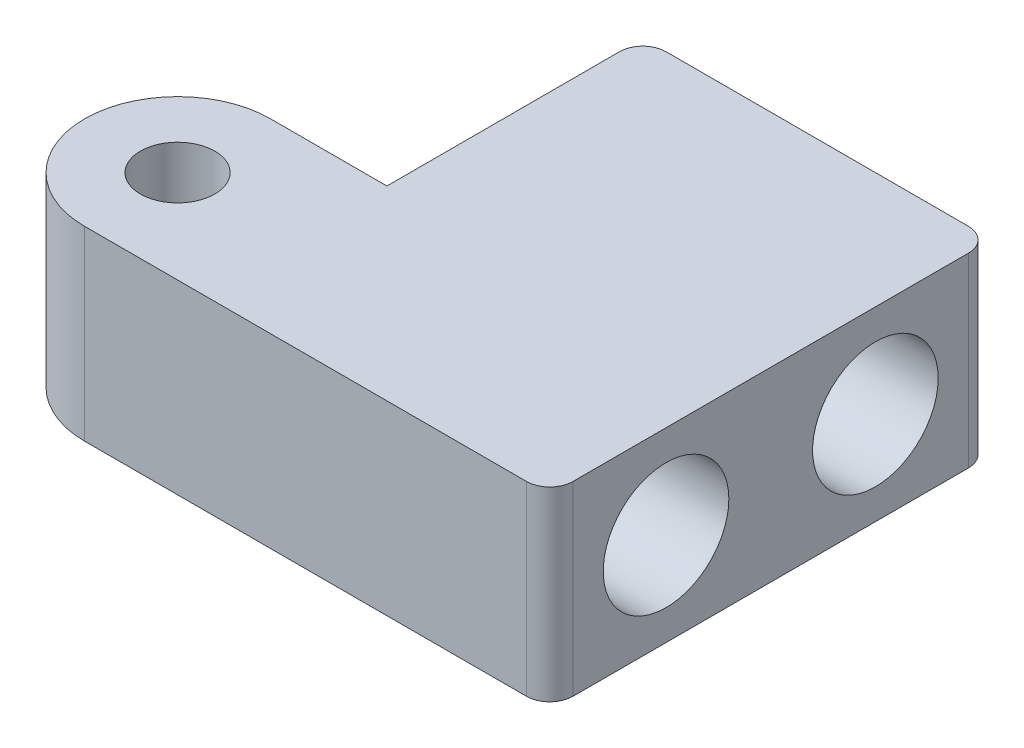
ISO-10303-21;
HEADER;
FILE_DESCRIPTION(('STEP AP214'),'2;1');
FILE_NAME('part.step','',(''),(''),'','','');
FILE_SCHEMA(('AUTOMOTIVE_DESIGN { 1 0 10303 214 1 1 1 1 }'));
ENDSEC;
DATA;
#1=APPLICATION_CONTEXT('core data for automotive mechanical design processes');
#2=APPLICATION_PROTOCOL_DEFINITION('international standard','automotive_design',2000,#1);
#3=PRODUCT_CONTEXT('',#1,'mechanical');
#4=PRODUCT('Part','Part','',(#3));
#5=PRODUCT_RELATED_PRODUCT_CATEGORY('part','',(#4));
#6=PRODUCT_DEFINITION_FORMATION('','',#4);
#7=PRODUCT_DEFINITION_CONTEXT('part definition',#1,'design');
#8=PRODUCT_DEFINITION('design','',#6,#7);
#9=PRODUCT_DEFINITION_SHAPE('','',#8);
#10=(LENGTH_UNIT() NAMED_UNIT(*) SI_UNIT(.MILLI.,.METRE.));
#11=(NAMED_UNIT(*) PLANE_ANGLE_UNIT() SI_UNIT($,.RADIAN.));
#12=(NAMED_UNIT(*) SI_UNIT($,.STERADIAN.) SOLID_ANGLE_UNIT());
#13=UNCERTAINTY_MEASURE_WITH_UNIT(LENGTH_MEASURE(1.E-05),#10,'distance_accuracy_value','');
#14=(GEOMETRIC_REPRESENTATION_CONTEXT(3) GLOBAL_UNCERTAINTY_ASSIGNED_CONTEXT((#13)) GLOBAL_UNIT_ASSIGNED_CONTEXT((#10,
#11,#12)) REPRESENTATION_CONTEXT('',''));
#15=CARTESIAN_POINT('',(0.,0.,0.));
#16=DIRECTION('',(0.,0.,1.));
#17=DIRECTION('',(1.,0.,0.));
#18=AXIS2_PLACEMENT_3D('',#15,#16,#17);
#19=CARTESIAN_POINT('',(20.,8.,0.));
#20=DIRECTION('',(1.,0.,0.));
#21=DIRECTION('',(0.,0.,-1.));
#22=AXIS2_PLACEMENT_3D('',#19,#20,#21);
#23=PLANE('',#22);
#24=CARTESIAN_POINT('',(20.,4.,-1.));
#25=DIRECTION('',(1.,0.,0.));
#26=DIRECTION('',(0.,0.,-1.));
#27=AXIS2_PLACEMENT_3D('',#24,#25,#26);
#28=CIRCLE('',#27,2.7);
#29=CARTESIAN_POINT('',(20.,4.,-3.7));
#30=VERTEX_POINT('',#29);
#31=EDGE_CURVE('E208',#30,#30,#28,.T.);
#32=ORIENTED_EDGE('',*,*,#31,.F.);
#33=EDGE_LOOP('',(#32));
#34=FACE_BOUND('',#33,.T.);
#35=CARTESIAN_POINT('',(20.,4.,-10.));
#36=DIRECTION('',(1.,0.,0.));
#37=DIRECTION('',(0.,0.,-1.));
#38=AXIS2_PLACEMENT_3D('',#35,#36,#37);
#39=CIRCLE('',#38,2.7);
#40=CARTESIAN_POINT('',(20.,4.,-12.7));
#41=VERTEX_POINT('',#40);
#42=EDGE_CURVE('E202',#41,#41,#39,.T.);
#43=ORIENTED_EDGE('',*,*,#42,.F.);
#44=EDGE_LOOP('',(#43));
#45=FACE_BOUND('',#44,.T.);
#46=DIRECTION('',(0.,0.,1.));
#47=VECTOR('',#46,1.);
#48=CARTESIAN_POINT('',(20.,8.,0.));
#49=LINE('',#48,#47);
#50=CARTESIAN_POINT('',(20.,8.,-14.));
#51=VERTEX_POINT('',#50);
#52=CARTESIAN_POINT('',(20.,8.,3.));
#53=VERTEX_POINT('',#52);
#54=EDGE_CURVE('E161',#51,#53,#49,.T.);
#55=ORIENTED_EDGE('',*,*,#54,.T.);
#56=DIRECTION('',(0.,-1.,0.));
#57=VECTOR('',#56,1.);
#58=CARTESIAN_POINT('',(20.,0.,3.));
#59=LINE('',#58,#57);
#60=CARTESIAN_POINT('',(20.,0.,3.));
#61=VERTEX_POINT('',#60);
#62=EDGE_CURVE('E43',#53,#61,#59,.T.);
#63=ORIENTED_EDGE('',*,*,#62,.T.);
#64=DIRECTION('',(0.,0.,1.));
#65=VECTOR('',#64,1.);
#66=CARTESIAN_POINT('',(20.,0.,0.));
#67=LINE('',#66,#65);
#68=CARTESIAN_POINT('',(20.,0.,-14.));
#69=VERTEX_POINT('',#68);
#70=EDGE_CURVE('E144',#69,#61,#67,.T.);
#71=ORIENTED_EDGE('',*,*,#70,.F.);
#72=DIRECTION('',(0.,-1.,0.));
#73=VECTOR('',#72,1.);
#74=CARTESIAN_POINT('',(20.,8.,-14.));
#75=LINE('',#74,#73);
#76=EDGE_CURVE('E181',#69,#51,#75,.F.);
#77=ORIENTED_EDGE('',*,*,#76,.T.);
#78=EDGE_LOOP('',(#55,#63,#71,#77));
#79=FACE_BOUND('',#78,.T.);
#80=ADVANCED_FACE('F35',(#34,#45,#79),#23,.T.);
#81=CARTESIAN_POINT('',(0.,8.,-15.));
#82=DIRECTION('',(0.,0.,-1.));
#83=DIRECTION('',(-1.,0.,0.));
#84=AXIS2_PLACEMENT_3D('',#81,#82,#83);
#85=PLANE('',#84);
#86=DIRECTION('',(1.,0.,0.));
#87=VECTOR('',#86,1.);
#88=CARTESIAN_POINT('',(0.,0.,-15.));
#89=LINE('',#88,#87);
#90=CARTESIAN_POINT('',(6.,0.,-15.));
#91=VERTEX_POINT('',#90);
#92=CARTESIAN_POINT('',(19.,0.,-15.));
#93=VERTEX_POINT('',#92);
#94=EDGE_CURVE('E147',#91,#93,#89,.T.);
#95=ORIENTED_EDGE('',*,*,#94,.F.);
#96=DIRECTION('',(0.,-1.,0.));
#97=VECTOR('',#96,1.);
#98=CARTESIAN_POINT('',(6.,8.,-15.));
#99=LINE('',#98,#97);
#100=CARTESIAN_POINT('',(6.,8.,-15.));
#101=VERTEX_POINT('',#100);
#102=EDGE_CURVE('E175',#91,#101,#99,.F.);
#103=ORIENTED_EDGE('',*,*,#102,.T.);
#104=DIRECTION('',(1.,0.,0.));
#105=VECTOR('',#104,1.);
#106=CARTESIAN_POINT('',(0.,8.,-15.));
#107=LINE('',#106,#105);
#108=CARTESIAN_POINT('',(19.,8.,-15.));
#109=VERTEX_POINT('',#108);
#110=EDGE_CURVE('E118',#101,#109,#107,.T.);
#111=ORIENTED_EDGE('',*,*,#110,.T.);
#112=DIRECTION('',(0.,-1.,0.));
#113=VECTOR('',#112,1.);
#114=CARTESIAN_POINT('',(19.,8.,-15.));
#115=LINE('',#114,#113);
#116=EDGE_CURVE('E172',#109,#93,#115,.T.);
#117=ORIENTED_EDGE('',*,*,#116,.T.);
#118=EDGE_LOOP('',(#95,#103,#111,#117));
#119=FACE_BOUND('',#118,.T.);
#120=ADVANCED_FACE('F198',(#119),#85,.T.);
#121=CARTESIAN_POINT('',(5.,8.,0.));
#122=DIRECTION('',(1.,0.,0.));
#123=DIRECTION('',(0.,0.,-1.));
#124=AXIS2_PLACEMENT_3D('',#121,#122,#123);
#125=PLANE('',#124);
#126=DIRECTION('',(0.,0.,1.));
#127=VECTOR('',#126,1.);
#128=CARTESIAN_POINT('',(5.,8.,0.));
#129=LINE('',#128,#127);
#130=CARTESIAN_POINT('',(5.,8.,-14.));
#131=VERTEX_POINT('',#130);
#132=CARTESIAN_POINT('',(5.,8.,-4.));
#133=VERTEX_POINT('',#132);
#134=EDGE_CURVE('E105',#131,#133,#129,.T.);
#135=ORIENTED_EDGE('',*,*,#134,.F.);
#136=DIRECTION('',(0.,-1.,0.));
#137=VECTOR('',#136,1.);
#138=CARTESIAN_POINT('',(5.,0.,-14.));
#139=LINE('',#138,#137);
#140=CARTESIAN_POINT('',(5.,0.,-14.));
#141=VERTEX_POINT('',#140);
#142=EDGE_CURVE('E127',#131,#141,#139,.T.);
#143=ORIENTED_EDGE('',*,*,#142,.T.);
#144=DIRECTION('',(0.,0.,1.));
#145=VECTOR('',#144,1.);
#146=CARTESIAN_POINT('',(5.,0.,0.));
#147=LINE('',#146,#145);
#148=CARTESIAN_POINT('',(5.,0.,-4.));
#149=VERTEX_POINT('',#148);
#150=EDGE_CURVE('E124',#141,#149,#147,.T.);
#151=ORIENTED_EDGE('',*,*,#150,.T.);
#152=DIRECTION('',(0.,-1.,0.));
#153=VECTOR('',#152,1.);
#154=CARTESIAN_POINT('',(5.,8.,-4.));
#155=LINE('',#154,#153);
#156=EDGE_CURVE('E121',#133,#149,#155,.T.);
#157=ORIENTED_EDGE('',*,*,#156,.F.);
#158=EDGE_LOOP('',(#135,#143,#151,#157));
#159=FACE_BOUND('',#158,.T.);
#160=ADVANCED_FACE('F122',(#159),#125,.F.);
#161=CARTESIAN_POINT('',(0.,8.,-4.));
#162=DIRECTION('',(0.,0.,1.));
#163=DIRECTION('',(1.,0.,0.));
#164=AXIS2_PLACEMENT_3D('',#161,#162,#163);
#165=PLANE('',#164);
#166=DIRECTION('',(-1.,0.,0.));
#167=VECTOR('',#166,1.);
#168=CARTESIAN_POINT('',(0.,0.,-4.));
#169=LINE('',#168,#167);
#170=CARTESIAN_POINT('',(0.,0.,-4.));
#171=VERTEX_POINT('',#170);
#172=EDGE_CURVE('E152',#149,#171,#169,.T.);
#173=ORIENTED_EDGE('',*,*,#172,.T.);
#174=DIRECTION('',(0.,-1.,0.));
#175=VECTOR('',#174,1.);
#176=CARTESIAN_POINT('',(0.,8.,-4.));
#177=LINE('',#176,#175);
#178=CARTESIAN_POINT('',(0.,8.,-4.));
#179=VERTEX_POINT('',#178);
#180=EDGE_CURVE('E128',#179,#171,#177,.T.);
#181=ORIENTED_EDGE('',*,*,#180,.F.);
#182=DIRECTION('',(-1.,0.,0.));
#183=VECTOR('',#182,1.);
#184=CARTESIAN_POINT('',(0.,8.,-4.));
#185=LINE('',#184,#183);
#186=EDGE_CURVE('E111',#133,#179,#185,.T.);
#187=ORIENTED_EDGE('',*,*,#186,.F.);
#188=ORIENTED_EDGE('',*,*,#156,.T.);
#189=EDGE_LOOP('',(#173,#181,#187,#188));
#190=FACE_BOUND('',#189,.T.);
#191=ADVANCED_FACE('F130',(#190),#165,.F.);
#192=CARTESIAN_POINT('',(0.,8.,0.));
#193=DIRECTION('',(0.,-1.,0.));
#194=DIRECTION('',(0.,0.,-1.));
#195=AXIS2_PLACEMENT_3D('',#192,#193,#194);
#196=CYLINDRICAL_SURFACE('',#195,4.);
#197=CARTESIAN_POINT('',(0.,0.,0.));
#198=DIRECTION('',(0.,1.,0.));
#199=DIRECTION('',(0.,0.,1.));
#200=AXIS2_PLACEMENT_3D('',#197,#198,#199);
#201=CIRCLE('',#200,4.);
#202=CARTESIAN_POINT('',(0.,0.,4.));
#203=VERTEX_POINT('',#202);
#204=EDGE_CURVE('E154',#171,#203,#201,.T.);
#205=ORIENTED_EDGE('',*,*,#204,.T.);
#206=DIRECTION('',(0.,-1.,0.));
#207=VECTOR('',#206,1.);
#208=CARTESIAN_POINT('',(0.,8.,4.));
#209=LINE('',#208,#207);
#210=CARTESIAN_POINT('',(0.,8.,4.));
#211=VERTEX_POINT('',#210);
#212=EDGE_CURVE('E143',#211,#203,#209,.T.);
#213=ORIENTED_EDGE('',*,*,#212,.F.);
#214=CARTESIAN_POINT('',(0.,8.,0.));
#215=DIRECTION('',(0.,1.,0.));
#216=DIRECTION('',(0.,0.,1.));
#217=AXIS2_PLACEMENT_3D('',#214,#215,#216);
#218=CIRCLE('',#217,4.);
#219=EDGE_CURVE('E133',#179,#211,#218,.T.);
#220=ORIENTED_EDGE('',*,*,#219,.F.);
#221=ORIENTED_EDGE('',*,*,#180,.T.);
#222=EDGE_LOOP('',(#205,#213,#220,#221));
#223=FACE_BOUND('',#222,.T.);
#224=ADVANCED_FACE('F250',(#223),#196,.T.);
#225=CARTESIAN_POINT('',(0.,8.,4.));
#226=DIRECTION('',(0.,0.,-1.));
#227=DIRECTION('',(-1.,0.,0.));
#228=AXIS2_PLACEMENT_3D('',#225,#226,#227);
#229=PLANE('',#228);
#230=DIRECTION('',(1.,0.,0.));
#231=VECTOR('',#230,1.);
#232=CARTESIAN_POINT('',(0.,0.,4.));
#233=LINE('',#232,#231);
#234=CARTESIAN_POINT('',(19.,0.,4.));
#235=VERTEX_POINT('',#234);
#236=EDGE_CURVE('E156',#203,#235,#233,.T.);
#237=ORIENTED_EDGE('',*,*,#236,.T.);
#238=DIRECTION('',(0.,-1.,0.));
#239=VECTOR('',#238,1.);
#240=CARTESIAN_POINT('',(19.,8.,4.));
#241=LINE('',#240,#239);
#242=CARTESIAN_POINT('',(19.,8.,4.));
#243=VERTEX_POINT('',#242);
#244=EDGE_CURVE('E11',#235,#243,#241,.F.);
#245=ORIENTED_EDGE('',*,*,#244,.T.);
#246=DIRECTION('',(1.,0.,0.));
#247=VECTOR('',#246,1.);
#248=CARTESIAN_POINT('',(0.,8.,4.));
#249=LINE('',#248,#247);
#250=EDGE_CURVE('E135',#211,#243,#249,.T.);
#251=ORIENTED_EDGE('',*,*,#250,.F.);
#252=ORIENTED_EDGE('',*,*,#212,.T.);
#253=EDGE_LOOP('',(#237,#245,#251,#252));
#254=FACE_BOUND('',#253,.T.);
#255=ADVANCED_FACE('F246',(#254),#229,.F.);
#256=CARTESIAN_POINT('',(0.,8.,0.));
#257=DIRECTION('',(0.,-1.,0.));
#258=DIRECTION('',(0.,0.,-1.));
#259=AXIS2_PLACEMENT_3D('',#256,#257,#258);
#260=CYLINDRICAL_SURFACE('',#259,1.6);
#261=CARTESIAN_POINT('',(0.,8.,0.));
#262=DIRECTION('',(0.,1.,0.));
#263=DIRECTION('',(0.,0.,1.));
#264=AXIS2_PLACEMENT_3D('',#261,#262,#263);
#265=CIRCLE('',#264,1.6);
#266=CARTESIAN_POINT('',(0.,8.,1.6));
#267=VERTEX_POINT('',#266);
#268=EDGE_CURVE('E140',#267,#267,#265,.T.);
#269=ORIENTED_EDGE('',*,*,#268,.T.);
#270=EDGE_LOOP('',(#269));
#271=FACE_BOUND('',#270,.T.);
#272=CARTESIAN_POINT('',(0.,0.,0.));
#273=DIRECTION('',(0.,1.,0.));
#274=DIRECTION('',(0.,0.,1.));
#275=AXIS2_PLACEMENT_3D('',#272,#273,#274);
#276=CIRCLE('',#275,1.6);
#277=CARTESIAN_POINT('',(0.,0.,1.6));
#278=VERTEX_POINT('',#277);
#279=EDGE_CURVE('E158',#278,#278,#276,.T.);
#280=ORIENTED_EDGE('',*,*,#279,.F.);
#281=EDGE_LOOP('',(#280));
#282=FACE_BOUND('',#281,.T.);
#283=ADVANCED_FACE('F242',(#271,#282),#260,.F.);
#284=CARTESIAN_POINT('',(0.,8.,0.));
#285=DIRECTION('',(0.,1.,0.));
#286=DIRECTION('',(0.,0.,1.));
#287=AXIS2_PLACEMENT_3D('',#284,#285,#286);
#288=PLANE('',#287);
#289=ORIENTED_EDGE('',*,*,#110,.F.);
#290=CARTESIAN_POINT('',(6.,8.,-14.));
#291=DIRECTION('',(0.,1.,0.));
#292=DIRECTION('',(0.,0.,1.));
#293=AXIS2_PLACEMENT_3D('',#290,#291,#292);
#294=CIRCLE('',#293,1.);
#295=EDGE_CURVE('E114',#101,#131,#294,.T.);
#296=ORIENTED_EDGE('',*,*,#295,.T.);
#297=ORIENTED_EDGE('',*,*,#134,.T.);
#298=ORIENTED_EDGE('',*,*,#186,.T.);
#299=ORIENTED_EDGE('',*,*,#219,.T.);
#300=ORIENTED_EDGE('',*,*,#250,.T.);
#301=CARTESIAN_POINT('',(19.,8.,3.));
#302=DIRECTION('',(0.,1.,0.));
#303=DIRECTION('',(0.,0.,1.));
#304=AXIS2_PLACEMENT_3D('',#301,#302,#303);
#305=CIRCLE('',#304,1.);
#306=EDGE_CURVE('E55',#243,#53,#305,.T.);
#307=ORIENTED_EDGE('',*,*,#306,.T.);
#308=ORIENTED_EDGE('',*,*,#54,.F.);
#309=CARTESIAN_POINT('',(19.,8.,-14.));
#310=DIRECTION('',(0.,1.,0.));
#311=DIRECTION('',(0.,0.,1.));
#312=AXIS2_PLACEMENT_3D('',#309,#310,#311);
#313=CIRCLE('',#312,1.);
#314=EDGE_CURVE('E177',#51,#109,#313,.T.);
#315=ORIENTED_EDGE('',*,*,#314,.T.);
#316=EDGE_LOOP('',(#289,#296,#297,#298,#299,#300,#307,#308,#315));
#317=FACE_BOUND('',#316,.T.);
#318=ORIENTED_EDGE('',*,*,#268,.F.);
#319=EDGE_LOOP('',(#318));
#320=FACE_BOUND('',#319,.T.);
#321=ADVANCED_FACE('F108',(#317,#320),#288,.T.);
#322=CARTESIAN_POINT('',(0.,0.,0.));
#323=DIRECTION('',(0.,1.,0.));
#324=DIRECTION('',(0.,0.,1.));
#325=AXIS2_PLACEMENT_3D('',#322,#323,#324);
#326=PLANE('',#325);
#327=ORIENTED_EDGE('',*,*,#150,.F.);
#328=CARTESIAN_POINT('',(6.,0.,-14.));
#329=DIRECTION('',(0.,1.,0.));
#330=DIRECTION('',(0.,0.,1.));
#331=AXIS2_PLACEMENT_3D('',#328,#329,#330);
#332=CIRCLE('',#331,1.);
#333=EDGE_CURVE('E170',#141,#91,#332,.F.);
#334=ORIENTED_EDGE('',*,*,#333,.T.);
#335=ORIENTED_EDGE('',*,*,#94,.T.);
#336=CARTESIAN_POINT('',(19.,0.,-14.));
#337=DIRECTION('',(0.,1.,0.));
#338=DIRECTION('',(0.,0.,1.));
#339=AXIS2_PLACEMENT_3D('',#336,#337,#338);
#340=CIRCLE('',#339,1.);
#341=EDGE_CURVE('E166',#93,#69,#340,.F.);
#342=ORIENTED_EDGE('',*,*,#341,.T.);
#343=ORIENTED_EDGE('',*,*,#70,.T.);
#344=CARTESIAN_POINT('',(19.,0.,3.));
#345=DIRECTION('',(0.,1.,0.));
#346=DIRECTION('',(0.,0.,1.));
#347=AXIS2_PLACEMENT_3D('',#344,#345,#346);
#348=CIRCLE('',#347,1.);
#349=EDGE_CURVE('E168',#61,#235,#348,.F.);
#350=ORIENTED_EDGE('',*,*,#349,.T.);
#351=ORIENTED_EDGE('',*,*,#236,.F.);
#352=ORIENTED_EDGE('',*,*,#204,.F.);
#353=ORIENTED_EDGE('',*,*,#172,.F.);
#354=EDGE_LOOP('',(#327,#334,#335,#342,#343,#350,#351,#352,#353));
#355=FACE_BOUND('',#354,.T.);
#356=ORIENTED_EDGE('',*,*,#279,.T.);
#357=EDGE_LOOP('',(#356));
#358=FACE_BOUND('',#357,.T.);
#359=ADVANCED_FACE('F189',(#355,#358),#326,.F.);
#360=CARTESIAN_POINT('',(9.99999999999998,4.,-10.));
#361=DIRECTION('',(1.,0.,0.));
#362=DIRECTION('',(0.,0.,-1.));
#363=AXIS2_PLACEMENT_3D('',#360,#361,#362);
#364=CYLINDRICAL_SURFACE('',#363,2.7);
#365=CARTESIAN_POINT('',(9.99999999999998,4.,-10.));
#366=DIRECTION('',(1.,0.,0.));
#367=DIRECTION('',(0.,0.,-1.));
#368=AXIS2_PLACEMENT_3D('',#365,#366,#367);
#369=CIRCLE('',#368,2.7);
#370=CARTESIAN_POINT('',(9.99999999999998,4.,-12.7));
#371=VERTEX_POINT('',#370);
#372=EDGE_CURVE('E148',#371,#371,#369,.T.);
#373=ORIENTED_EDGE('',*,*,#372,.F.);
#374=EDGE_LOOP('',(#373));
#375=FACE_BOUND('',#374,.T.);
#376=ORIENTED_EDGE('',*,*,#42,.T.);
#377=EDGE_LOOP('',(#376));
#378=FACE_BOUND('',#377,.T.);
#379=ADVANCED_FACE('F228',(#375,#378),#364,.F.);
#380=CARTESIAN_POINT('',(9.99999999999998,4.,-10.));
#381=DIRECTION('',(1.,0.,0.));
#382=DIRECTION('',(0.,0.,-1.));
#383=AXIS2_PLACEMENT_3D('',#380,#381,#382);
#384=PLANE('',#383);
#385=ORIENTED_EDGE('',*,*,#372,.T.);
#386=EDGE_LOOP('',(#385));
#387=FACE_BOUND('',#386,.T.);
#388=ADVANCED_FACE('F219',(#387),#384,.T.);
#389=CARTESIAN_POINT('',(9.99999999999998,4.,-1.));
#390=DIRECTION('',(1.,0.,0.));
#391=DIRECTION('',(0.,0.,-1.));
#392=AXIS2_PLACEMENT_3D('',#389,#390,#391);
#393=CYLINDRICAL_SURFACE('',#392,2.7);
#394=CARTESIAN_POINT('',(9.99999999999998,4.,-1.));
#395=DIRECTION('',(1.,0.,0.));
#396=DIRECTION('',(0.,0.,-1.));
#397=AXIS2_PLACEMENT_3D('',#394,#395,#396);
#398=CIRCLE('',#397,2.7);
#399=CARTESIAN_POINT('',(9.99999999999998,4.,-3.7));
#400=VERTEX_POINT('',#399);
#401=EDGE_CURVE('E205',#400,#400,#398,.T.);
#402=ORIENTED_EDGE('',*,*,#401,.F.);
#403=EDGE_LOOP('',(#402));
#404=FACE_BOUND('',#403,.T.);
#405=ORIENTED_EDGE('',*,*,#31,.T.);
#406=EDGE_LOOP('',(#405));
#407=FACE_BOUND('',#406,.T.);
#408=ADVANCED_FACE('F216',(#404,#407),#393,.F.);
#409=CARTESIAN_POINT('',(9.99999999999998,4.,-1.));
#410=DIRECTION('',(1.,0.,0.));
#411=DIRECTION('',(0.,0.,-1.));
#412=AXIS2_PLACEMENT_3D('',#409,#410,#411);
#413=PLANE('',#412);
#414=ORIENTED_EDGE('',*,*,#401,.T.);
#415=EDGE_LOOP('',(#414));
#416=FACE_BOUND('',#415,.T.);
#417=ADVANCED_FACE('F214',(#416),#413,.T.);
#418=CARTESIAN_POINT('',(6.,8.,-14.));
#419=DIRECTION('',(0.,1.,0.));
#420=DIRECTION('',(0.,0.,1.));
#421=AXIS2_PLACEMENT_3D('',#418,#419,#420);
#422=CYLINDRICAL_SURFACE('',#421,1.);
#423=ORIENTED_EDGE('',*,*,#295,.F.);
#424=ORIENTED_EDGE('',*,*,#102,.F.);
#425=ORIENTED_EDGE('',*,*,#333,.F.);
#426=ORIENTED_EDGE('',*,*,#142,.F.);
#427=EDGE_LOOP('',(#423,#424,#425,#426));
#428=FACE_BOUND('',#427,.T.);
#429=ADVANCED_FACE('F260',(#428),#422,.T.);
#430=CARTESIAN_POINT('',(19.,8.,3.));
#431=DIRECTION('',(0.,1.,0.));
#432=DIRECTION('',(0.,0.,1.));
#433=AXIS2_PLACEMENT_3D('',#430,#431,#432);
#434=CYLINDRICAL_SURFACE('',#433,1.);
#435=ORIENTED_EDGE('',*,*,#306,.F.);
#436=ORIENTED_EDGE('',*,*,#244,.F.);
#437=ORIENTED_EDGE('',*,*,#349,.F.);
#438=ORIENTED_EDGE('',*,*,#62,.F.);
#439=EDGE_LOOP('',(#435,#436,#437,#438));
#440=FACE_BOUND('',#439,.T.);
#441=ADVANCED_FACE('F262',(#440),#434,.T.);
#442=CARTESIAN_POINT('',(19.,8.,-14.));
#443=DIRECTION('',(0.,-1.,0.));
#444=DIRECTION('',(0.,0.,-1.));
#445=AXIS2_PLACEMENT_3D('',#442,#443,#444);
#446=CYLINDRICAL_SURFACE('',#445,1.);
#447=ORIENTED_EDGE('',*,*,#314,.F.);
#448=ORIENTED_EDGE('',*,*,#76,.F.);
#449=ORIENTED_EDGE('',*,*,#341,.F.);
#450=ORIENTED_EDGE('',*,*,#116,.F.);
#451=EDGE_LOOP('',(#447,#448,#449,#450));
#452=FACE_BOUND('',#451,.T.);
#453=ADVANCED_FACE('F37',(#452),#446,.T.);
#454=CLOSED_SHELL('',(#80,#120,#160,#191,#224,#255,#283,#321,#359,#379,#388,#408,#417,#429,#441,#453));
#455=MANIFOLD_SOLID_BREP('B2',#454);
#456=ADVANCED_BREP_SHAPE_REPRESENTATION('',(#18,#455),#14);
#457=SHAPE_DEFINITION_REPRESENTATION(#9,#456);
ENDSEC;
END-ISO-10303-21;
